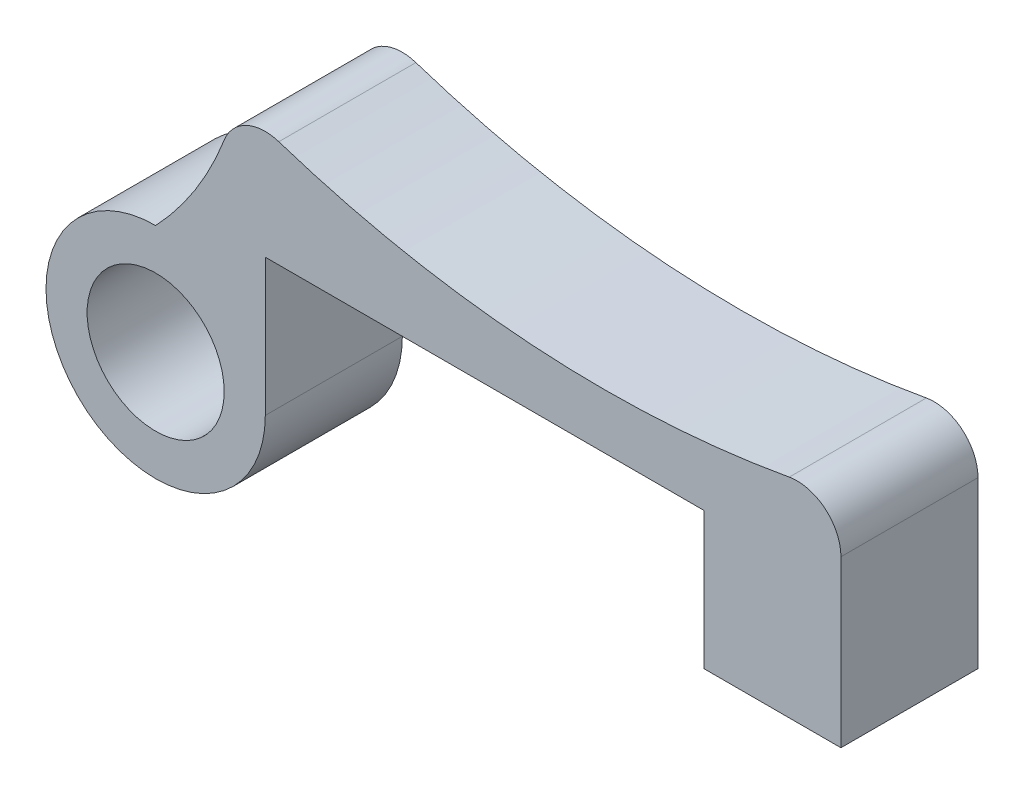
ISO-10303-21;
HEADER;
FILE_DESCRIPTION(('STEP AP214'),'2;1');
FILE_NAME('part.step','',(''),(''),'','','');
FILE_SCHEMA(('AUTOMOTIVE_DESIGN { 1 0 10303 214 1 1 1 1 }'));
ENDSEC;
DATA;
#1=APPLICATION_CONTEXT('core data for automotive mechanical design processes');
#2=APPLICATION_PROTOCOL_DEFINITION('international standard','automotive_design',2000,#1);
#3=PRODUCT_CONTEXT('',#1,'mechanical');
#4=PRODUCT('Part','Part','',(#3));
#5=PRODUCT_RELATED_PRODUCT_CATEGORY('part','',(#4));
#6=PRODUCT_DEFINITION_FORMATION('','',#4);
#7=PRODUCT_DEFINITION_CONTEXT('part definition',#1,'design');
#8=PRODUCT_DEFINITION('design','',#6,#7);
#9=PRODUCT_DEFINITION_SHAPE('','',#8);
#10=(LENGTH_UNIT() NAMED_UNIT(*) SI_UNIT(.MILLI.,.METRE.));
#11=(NAMED_UNIT(*) PLANE_ANGLE_UNIT() SI_UNIT($,.RADIAN.));
#12=(NAMED_UNIT(*) SI_UNIT($,.STERADIAN.) SOLID_ANGLE_UNIT());
#13=UNCERTAINTY_MEASURE_WITH_UNIT(LENGTH_MEASURE(1.E-05),#10,'distance_accuracy_value','');
#14=(GEOMETRIC_REPRESENTATION_CONTEXT(3) GLOBAL_UNCERTAINTY_ASSIGNED_CONTEXT((#13)) GLOBAL_UNIT_ASSIGNED_CONTEXT((#10,
#11,#12)) REPRESENTATION_CONTEXT('',''));
#15=CARTESIAN_POINT('',(0.,0.,0.));
#16=DIRECTION('',(0.,0.,1.));
#17=DIRECTION('',(1.,0.,0.));
#18=AXIS2_PLACEMENT_3D('',#15,#16,#17);
#19=CARTESIAN_POINT('',(10.3757386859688,28.575,3.175));
#20=DIRECTION('',(0.,0.,-1.));
#21=DIRECTION('',(-1.,0.,0.));
#22=AXIS2_PLACEMENT_3D('',#19,#20,#21);
#23=CYLINDRICAL_SURFACE('',#22,24.13);
#24=CARTESIAN_POINT('',(10.3757386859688,28.575,3.175));
#25=DIRECTION('',(0.,0.,1.));
#26=DIRECTION('',(1.,0.,0.));
#27=AXIS2_PLACEMENT_3D('',#24,#25,#26);
#28=CIRCLE('',#27,24.13);
#29=CARTESIAN_POINT('',(2.85312377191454,5.64756741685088,3.175));
#30=VERTEX_POINT('',#29);
#31=CARTESIAN_POINT('',(14.677858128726,4.83160790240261,3.175));
#32=VERTEX_POINT('',#31);
#33=EDGE_CURVE('E139',#30,#32,#28,.T.);
#34=ORIENTED_EDGE('',*,*,#33,.T.);
#35=DIRECTION('',(0.,0.,-1.));
#36=VECTOR('',#35,1.);
#37=CARTESIAN_POINT('',(14.677858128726,4.83160790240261,3.175));
#38=LINE('',#37,#36);
#39=CARTESIAN_POINT('',(14.677858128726,4.83160790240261,0.));
#40=VERTEX_POINT('',#39);
#41=EDGE_CURVE('E193',#32,#40,#38,.T.);
#42=ORIENTED_EDGE('',*,*,#41,.T.);
#43=CARTESIAN_POINT('',(10.3757386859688,28.575,0.));
#44=DIRECTION('',(0.,0.,1.));
#45=DIRECTION('',(1.,0.,0.));
#46=AXIS2_PLACEMENT_3D('',#43,#44,#45);
#47=CIRCLE('',#46,24.13);
#48=CARTESIAN_POINT('',(2.85312377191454,5.64756741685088,0.));
#49=VERTEX_POINT('',#48);
#50=EDGE_CURVE('E158',#49,#40,#47,.T.);
#51=ORIENTED_EDGE('',*,*,#50,.F.);
#52=DIRECTION('',(0.,0.,-1.));
#53=VECTOR('',#52,1.);
#54=CARTESIAN_POINT('',(2.85312377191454,5.64756741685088,3.175));
#55=LINE('',#54,#53);
#56=EDGE_CURVE('E190',#49,#30,#55,.F.);
#57=ORIENTED_EDGE('',*,*,#56,.T.);
#58=EDGE_LOOP('',(#34,#42,#51,#57));
#59=FACE_BOUND('',#58,.T.);
#60=ADVANCED_FACE('F35',(#59),#23,.F.);
#61=CARTESIAN_POINT('',(-5.51980612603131,7.79320286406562,3.175));
#62=DIRECTION('',(0.,0.,-1.));
#63=DIRECTION('',(-1.,0.,0.));
#64=AXIS2_PLACEMENT_3D('',#61,#62,#63);
#65=CYLINDRICAL_SURFACE('',#64,7.62);
#66=CARTESIAN_POINT('',(-5.51980612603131,7.79320286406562,3.175));
#67=DIRECTION('',(0.,0.,1.));
#68=DIRECTION('',(1.,0.,0.));
#69=AXIS2_PLACEMENT_3D('',#66,#67,#68);
#70=CIRCLE('',#69,7.62);
#71=CARTESIAN_POINT('',(0.,2.54,3.175));
#72=VERTEX_POINT('',#71);
#73=CARTESIAN_POINT('',(1.5885952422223,5.04820195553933,3.175));
#74=VERTEX_POINT('',#73);
#75=EDGE_CURVE('E117',#72,#74,#70,.T.);
#76=ORIENTED_EDGE('',*,*,#75,.T.);
#77=DIRECTION('',(0.,0.,-1.));
#78=VECTOR('',#77,1.);
#79=CARTESIAN_POINT('',(1.5885952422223,5.04820195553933,3.175));
#80=LINE('',#79,#78);
#81=CARTESIAN_POINT('',(1.5885952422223,5.04820195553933,0.));
#82=VERTEX_POINT('',#81);
#83=EDGE_CURVE('E123',#74,#82,#80,.T.);
#84=ORIENTED_EDGE('',*,*,#83,.T.);
#85=CARTESIAN_POINT('',(-5.51980612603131,7.79320286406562,0.));
#86=DIRECTION('',(0.,0.,1.));
#87=DIRECTION('',(1.,0.,0.));
#88=AXIS2_PLACEMENT_3D('',#85,#86,#87);
#89=CIRCLE('',#88,7.62);
#90=CARTESIAN_POINT('',(0.,2.54,0.));
#91=VERTEX_POINT('',#90);
#92=EDGE_CURVE('E120',#91,#82,#89,.T.);
#93=ORIENTED_EDGE('',*,*,#92,.F.);
#94=DIRECTION('',(0.,0.,-1.));
#95=VECTOR('',#94,1.);
#96=CARTESIAN_POINT('',(0.,2.54,3.175));
#97=LINE('',#96,#95);
#98=EDGE_CURVE('E112',#72,#91,#97,.T.);
#99=ORIENTED_EDGE('',*,*,#98,.F.);
#100=EDGE_LOOP('',(#76,#84,#93,#99));
#101=FACE_BOUND('',#100,.T.);
#102=ADVANCED_FACE('F114',(#101),#65,.F.);
#103=CARTESIAN_POINT('',(0.,0.,3.175));
#104=DIRECTION('',(0.,0.,-1.));
#105=DIRECTION('',(-1.,0.,0.));
#106=AXIS2_PLACEMENT_3D('',#103,#104,#105);
#107=CYLINDRICAL_SURFACE('',#106,2.54);
#108=CARTESIAN_POINT('',(0.,0.,0.));
#109=DIRECTION('',(0.,0.,1.));
#110=DIRECTION('',(1.,0.,0.));
#111=AXIS2_PLACEMENT_3D('',#108,#109,#110);
#112=CIRCLE('',#111,2.54);
#113=CARTESIAN_POINT('',(2.54,0.,0.));
#114=VERTEX_POINT('',#113);
#115=EDGE_CURVE('E161',#91,#114,#112,.T.);
#116=ORIENTED_EDGE('',*,*,#115,.T.);
#117=DIRECTION('',(0.,0.,-1.));
#118=VECTOR('',#117,1.);
#119=CARTESIAN_POINT('',(2.54,0.,3.175));
#120=LINE('',#119,#118);
#121=CARTESIAN_POINT('',(2.54,0.,3.175));
#122=VERTEX_POINT('',#121);
#123=EDGE_CURVE('E124',#122,#114,#120,.T.);
#124=ORIENTED_EDGE('',*,*,#123,.F.);
#125=CARTESIAN_POINT('',(0.,0.,3.175));
#126=DIRECTION('',(0.,0.,1.));
#127=DIRECTION('',(1.,0.,0.));
#128=AXIS2_PLACEMENT_3D('',#125,#126,#127);
#129=CIRCLE('',#128,2.54);
#130=EDGE_CURVE('E127',#72,#122,#129,.T.);
#131=ORIENTED_EDGE('',*,*,#130,.F.);
#132=ORIENTED_EDGE('',*,*,#98,.T.);
#133=EDGE_LOOP('',(#116,#124,#131,#132));
#134=FACE_BOUND('',#133,.T.);
#135=ADVANCED_FACE('F128',(#134),#107,.T.);
#136=CARTESIAN_POINT('',(2.54,0.,3.175));
#137=DIRECTION('',(-1.,0.,0.));
#138=DIRECTION('',(0.,-1.,0.));
#139=AXIS2_PLACEMENT_3D('',#136,#137,#138);
#140=PLANE('',#139);
#141=DIRECTION('',(0.,1.,0.));
#142=VECTOR('',#141,1.);
#143=CARTESIAN_POINT('',(2.54,0.,0.));
#144=LINE('',#143,#142);
#145=CARTESIAN_POINT('',(2.54,3.175,0.));
#146=VERTEX_POINT('',#145);
#147=EDGE_CURVE('E163',#114,#146,#144,.T.);
#148=ORIENTED_EDGE('',*,*,#147,.T.);
#149=DIRECTION('',(0.,0.,-1.));
#150=VECTOR('',#149,1.);
#151=CARTESIAN_POINT('',(2.54,3.175,3.175));
#152=LINE('',#151,#150);
#153=CARTESIAN_POINT('',(2.54,3.175,3.175));
#154=VERTEX_POINT('',#153);
#155=EDGE_CURVE('E183',#154,#146,#152,.T.);
#156=ORIENTED_EDGE('',*,*,#155,.F.);
#157=DIRECTION('',(0.,1.,0.));
#158=VECTOR('',#157,1.);
#159=CARTESIAN_POINT('',(2.54,0.,3.175));
#160=LINE('',#159,#158);
#161=EDGE_CURVE('E132',#122,#154,#160,.T.);
#162=ORIENTED_EDGE('',*,*,#161,.F.);
#163=ORIENTED_EDGE('',*,*,#123,.T.);
#164=EDGE_LOOP('',(#148,#156,#162,#163));
#165=FACE_BOUND('',#164,.T.);
#166=ADVANCED_FACE('F219',(#165),#140,.F.);
#167=CARTESIAN_POINT('',(0.,3.175,3.175));
#168=DIRECTION('',(0.,1.,0.));
#169=DIRECTION('',(0.,0.,1.));
#170=AXIS2_PLACEMENT_3D('',#167,#168,#169);
#171=PLANE('',#170);
#172=DIRECTION('',(1.,0.,0.));
#173=VECTOR('',#172,1.);
#174=CARTESIAN_POINT('',(0.,3.175,0.));
#175=LINE('',#174,#173);
#176=CARTESIAN_POINT('',(12.7,3.175,0.));
#177=VERTEX_POINT('',#176);
#178=EDGE_CURVE('E165',#146,#177,#175,.T.);
#179=ORIENTED_EDGE('',*,*,#178,.T.);
#180=DIRECTION('',(0.,0.,-1.));
#181=VECTOR('',#180,1.);
#182=CARTESIAN_POINT('',(12.7,3.175,3.175));
#183=LINE('',#182,#181);
#184=CARTESIAN_POINT('',(12.7,3.175,3.175));
#185=VERTEX_POINT('',#184);
#186=EDGE_CURVE('E180',#185,#177,#183,.T.);
#187=ORIENTED_EDGE('',*,*,#186,.F.);
#188=DIRECTION('',(1.,0.,0.));
#189=VECTOR('',#188,1.);
#190=CARTESIAN_POINT('',(0.,3.175,3.175));
#191=LINE('',#190,#189);
#192=EDGE_CURVE('E146',#154,#185,#191,.T.);
#193=ORIENTED_EDGE('',*,*,#192,.F.);
#194=ORIENTED_EDGE('',*,*,#155,.T.);
#195=EDGE_LOOP('',(#179,#187,#193,#194));
#196=FACE_BOUND('',#195,.T.);
#197=ADVANCED_FACE('F222',(#196),#171,.F.);
#198=CARTESIAN_POINT('',(12.7,0.,3.175));
#199=DIRECTION('',(1.,0.,0.));
#200=DIRECTION('',(0.,0.,-1.));
#201=AXIS2_PLACEMENT_3D('',#198,#199,#200);
#202=PLANE('',#201);
#203=DIRECTION('',(0.,-1.,0.));
#204=VECTOR('',#203,1.);
#205=CARTESIAN_POINT('',(12.7,0.,0.));
#206=LINE('',#205,#204);
#207=CARTESIAN_POINT('',(12.7,0.,0.));
#208=VERTEX_POINT('',#207);
#209=EDGE_CURVE('E167',#177,#208,#206,.T.);
#210=ORIENTED_EDGE('',*,*,#209,.T.);
#211=DIRECTION('',(0.,0.,-1.));
#212=VECTOR('',#211,1.);
#213=CARTESIAN_POINT('',(12.7,0.,3.175));
#214=LINE('',#213,#212);
#215=CARTESIAN_POINT('',(12.7,0.,3.175));
#216=VERTEX_POINT('',#215);
#217=EDGE_CURVE('E177',#216,#208,#214,.T.);
#218=ORIENTED_EDGE('',*,*,#217,.F.);
#219=DIRECTION('',(0.,-1.,0.));
#220=VECTOR('',#219,1.);
#221=CARTESIAN_POINT('',(12.7,0.,3.175));
#222=LINE('',#221,#220);
#223=EDGE_CURVE('E148',#185,#216,#222,.T.);
#224=ORIENTED_EDGE('',*,*,#223,.F.);
#225=ORIENTED_EDGE('',*,*,#186,.T.);
#226=EDGE_LOOP('',(#210,#218,#224,#225));
#227=FACE_BOUND('',#226,.T.);
#228=ADVANCED_FACE('F226',(#227),#202,.F.);
#229=CARTESIAN_POINT('',(0.,0.,3.175));
#230=DIRECTION('',(0.,1.,0.));
#231=DIRECTION('',(0.,0.,1.));
#232=AXIS2_PLACEMENT_3D('',#229,#230,#231);
#233=PLANE('',#232);
#234=DIRECTION('',(1.,0.,0.));
#235=VECTOR('',#234,1.);
#236=CARTESIAN_POINT('',(0.,0.,0.));
#237=LINE('',#236,#235);
#238=CARTESIAN_POINT('',(15.875,0.,0.));
#239=VERTEX_POINT('',#238);
#240=EDGE_CURVE('E169',#208,#239,#237,.T.);
#241=ORIENTED_EDGE('',*,*,#240,.T.);
#242=DIRECTION('',(0.,0.,-1.));
#243=VECTOR('',#242,1.);
#244=CARTESIAN_POINT('',(15.875,0.,3.175));
#245=LINE('',#244,#243);
#246=CARTESIAN_POINT('',(15.875,0.,3.175));
#247=VERTEX_POINT('',#246);
#248=EDGE_CURVE('E157',#247,#239,#245,.T.);
#249=ORIENTED_EDGE('',*,*,#248,.F.);
#250=DIRECTION('',(1.,0.,0.));
#251=VECTOR('',#250,1.);
#252=CARTESIAN_POINT('',(0.,0.,3.175));
#253=LINE('',#252,#251);
#254=EDGE_CURVE('E150',#216,#247,#253,.T.);
#255=ORIENTED_EDGE('',*,*,#254,.F.);
#256=ORIENTED_EDGE('',*,*,#217,.T.);
#257=EDGE_LOOP('',(#241,#249,#255,#256));
#258=FACE_BOUND('',#257,.T.);
#259=ADVANCED_FACE('F230',(#258),#233,.F.);
#260=CARTESIAN_POINT('',(15.875,0.,3.175));
#261=DIRECTION('',(-1.,0.,0.));
#262=DIRECTION('',(0.,0.,1.));
#263=AXIS2_PLACEMENT_3D('',#260,#261,#262);
#264=PLANE('',#263);
#265=DIRECTION('',(0.,1.,0.));
#266=VECTOR('',#265,1.);
#267=CARTESIAN_POINT('',(15.875,0.,0.));
#268=LINE('',#267,#266);
#269=CARTESIAN_POINT('',(15.875,3.83188612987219,0.));
#270=VERTEX_POINT('',#269);
#271=EDGE_CURVE('E171',#239,#270,#268,.T.);
#272=ORIENTED_EDGE('',*,*,#271,.T.);
#273=DIRECTION('',(0.,0.,1.));
#274=VECTOR('',#273,1.);
#275=CARTESIAN_POINT('',(15.875,3.83188612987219,3.175));
#276=LINE('',#275,#274);
#277=CARTESIAN_POINT('',(15.875,3.83188612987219,3.175));
#278=VERTEX_POINT('',#277);
#279=EDGE_CURVE('E43',#270,#278,#276,.T.);
#280=ORIENTED_EDGE('',*,*,#279,.T.);
#281=DIRECTION('',(0.,1.,0.));
#282=VECTOR('',#281,1.);
#283=CARTESIAN_POINT('',(15.875,0.,3.175));
#284=LINE('',#283,#282);
#285=EDGE_CURVE('E152',#247,#278,#284,.T.);
#286=ORIENTED_EDGE('',*,*,#285,.F.);
#287=ORIENTED_EDGE('',*,*,#248,.T.);
#288=EDGE_LOOP('',(#272,#280,#286,#287));
#289=FACE_BOUND('',#288,.T.);
#290=ADVANCED_FACE('F234',(#289),#264,.F.);
#291=CARTESIAN_POINT('',(0.,0.,3.175));
#292=DIRECTION('',(0.,0.,-1.));
#293=DIRECTION('',(-1.,0.,0.));
#294=AXIS2_PLACEMENT_3D('',#291,#292,#293);
#295=CYLINDRICAL_SURFACE('',#294,1.5875);
#296=CARTESIAN_POINT('',(0.,0.,3.175));
#297=DIRECTION('',(0.,0.,1.));
#298=DIRECTION('',(1.,0.,0.));
#299=AXIS2_PLACEMENT_3D('',#296,#297,#298);
#300=CIRCLE('',#299,1.5875);
#301=CARTESIAN_POINT('',(1.5875,0.,3.175));
#302=VERTEX_POINT('',#301);
#303=EDGE_CURVE('E154',#302,#302,#300,.T.);
#304=ORIENTED_EDGE('',*,*,#303,.T.);
#305=EDGE_LOOP('',(#304));
#306=FACE_BOUND('',#305,.T.);
#307=CARTESIAN_POINT('',(0.,0.,0.));
#308=DIRECTION('',(0.,0.,1.));
#309=DIRECTION('',(1.,0.,0.));
#310=AXIS2_PLACEMENT_3D('',#307,#308,#309);
#311=CIRCLE('',#310,1.5875);
#312=CARTESIAN_POINT('',(1.5875,0.,0.));
#313=VERTEX_POINT('',#312);
#314=EDGE_CURVE('E142',#313,#313,#311,.T.);
#315=ORIENTED_EDGE('',*,*,#314,.F.);
#316=EDGE_LOOP('',(#315));
#317=FACE_BOUND('',#316,.T.);
#318=ADVANCED_FACE('F238',(#306,#317),#295,.F.);
#319=CARTESIAN_POINT('',(0.,0.,3.175));
#320=DIRECTION('',(0.,0.,1.));
#321=DIRECTION('',(1.,0.,0.));
#322=AXIS2_PLACEMENT_3D('',#319,#320,#321);
#323=PLANE('',#322);
#324=ORIENTED_EDGE('',*,*,#285,.T.);
#325=CARTESIAN_POINT('',(14.859,3.83188612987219,3.175));
#326=DIRECTION('',(0.,0.,1.));
#327=DIRECTION('',(1.,0.,0.));
#328=AXIS2_PLACEMENT_3D('',#325,#326,#327);
#329=CIRCLE('',#328,1.016);
#330=EDGE_CURVE('E11',#278,#32,#329,.T.);
#331=ORIENTED_EDGE('',*,*,#330,.T.);
#332=ORIENTED_EDGE('',*,*,#33,.F.);
#333=CARTESIAN_POINT('',(2.53638209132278,4.68220183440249,3.175));
#334=DIRECTION('',(0.,0.,1.));
#335=DIRECTION('',(1.,0.,0.));
#336=AXIS2_PLACEMENT_3D('',#333,#334,#335);
#337=CIRCLE('',#336,1.016);
#338=EDGE_CURVE('E138',#30,#74,#337,.T.);
#339=ORIENTED_EDGE('',*,*,#338,.T.);
#340=ORIENTED_EDGE('',*,*,#75,.F.);
#341=ORIENTED_EDGE('',*,*,#130,.T.);
#342=ORIENTED_EDGE('',*,*,#161,.T.);
#343=ORIENTED_EDGE('',*,*,#192,.T.);
#344=ORIENTED_EDGE('',*,*,#223,.T.);
#345=ORIENTED_EDGE('',*,*,#254,.T.);
#346=EDGE_LOOP('',(#324,#331,#332,#339,#340,#341,#342,#343,#344,#345));
#347=FACE_BOUND('',#346,.T.);
#348=ORIENTED_EDGE('',*,*,#303,.F.);
#349=EDGE_LOOP('',(#348));
#350=FACE_BOUND('',#349,.T.);
#351=ADVANCED_FACE('F134',(#347,#350),#323,.T.);
#352=CARTESIAN_POINT('',(0.,0.,0.));
#353=DIRECTION('',(0.,0.,1.));
#354=DIRECTION('',(1.,0.,0.));
#355=AXIS2_PLACEMENT_3D('',#352,#353,#354);
#356=PLANE('',#355);
#357=ORIENTED_EDGE('',*,*,#50,.T.);
#358=CARTESIAN_POINT('',(14.859,3.83188612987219,0.));
#359=DIRECTION('',(0.,0.,1.));
#360=DIRECTION('',(1.,0.,0.));
#361=AXIS2_PLACEMENT_3D('',#358,#359,#360);
#362=CIRCLE('',#361,1.016);
#363=EDGE_CURVE('E57',#40,#270,#362,.F.);
#364=ORIENTED_EDGE('',*,*,#363,.T.);
#365=ORIENTED_EDGE('',*,*,#271,.F.);
#366=ORIENTED_EDGE('',*,*,#240,.F.);
#367=ORIENTED_EDGE('',*,*,#209,.F.);
#368=ORIENTED_EDGE('',*,*,#178,.F.);
#369=ORIENTED_EDGE('',*,*,#147,.F.);
#370=ORIENTED_EDGE('',*,*,#115,.F.);
#371=ORIENTED_EDGE('',*,*,#92,.T.);
#372=CARTESIAN_POINT('',(2.53638209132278,4.68220183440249,0.));
#373=DIRECTION('',(0.,0.,1.));
#374=DIRECTION('',(1.,0.,0.));
#375=AXIS2_PLACEMENT_3D('',#372,#373,#374);
#376=CIRCLE('',#375,1.016);
#377=EDGE_CURVE('E188',#82,#49,#376,.F.);
#378=ORIENTED_EDGE('',*,*,#377,.T.);
#379=EDGE_LOOP('',(#357,#364,#365,#366,#367,#368,#369,#370,#371,#378));
#380=FACE_BOUND('',#379,.T.);
#381=ORIENTED_EDGE('',*,*,#314,.T.);
#382=EDGE_LOOP('',(#381));
#383=FACE_BOUND('',#382,.T.);
#384=ADVANCED_FACE('F202',(#380,#383),#356,.F.);
#385=CARTESIAN_POINT('',(2.53638209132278,4.68220183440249,3.175));
#386=DIRECTION('',(0.,0.,-1.));
#387=DIRECTION('',(-1.,0.,0.));
#388=AXIS2_PLACEMENT_3D('',#385,#386,#387);
#389=CYLINDRICAL_SURFACE('',#388,1.016);
#390=ORIENTED_EDGE('',*,*,#338,.F.);
#391=ORIENTED_EDGE('',*,*,#56,.F.);
#392=ORIENTED_EDGE('',*,*,#377,.F.);
#393=ORIENTED_EDGE('',*,*,#83,.F.);
#394=EDGE_LOOP('',(#390,#391,#392,#393));
#395=FACE_BOUND('',#394,.T.);
#396=ADVANCED_FACE('F205',(#395),#389,.T.);
#397=CARTESIAN_POINT('',(14.859,3.83188612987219,3.175));
#398=DIRECTION('',(0.,0.,-1.));
#399=DIRECTION('',(-1.,0.,0.));
#400=AXIS2_PLACEMENT_3D('',#397,#398,#399);
#401=CYLINDRICAL_SURFACE('',#400,1.016);
#402=ORIENTED_EDGE('',*,*,#330,.F.);
#403=ORIENTED_EDGE('',*,*,#279,.F.);
#404=ORIENTED_EDGE('',*,*,#363,.F.);
#405=ORIENTED_EDGE('',*,*,#41,.F.);
#406=EDGE_LOOP('',(#402,#403,#404,#405));
#407=FACE_BOUND('',#406,.T.);
#408=ADVANCED_FACE('F37',(#407),#401,.T.);
#409=CLOSED_SHELL('',(#60,#102,#135,#166,#197,#228,#259,#290,#318,#351,#384,#396,#408));
#410=MANIFOLD_SOLID_BREP('B2',#409);
#411=ADVANCED_BREP_SHAPE_REPRESENTATION('',(#18,#410),#14);
#412=SHAPE_DEFINITION_REPRESENTATION(#9,#411);
ENDSEC;
END-ISO-10303-21;
